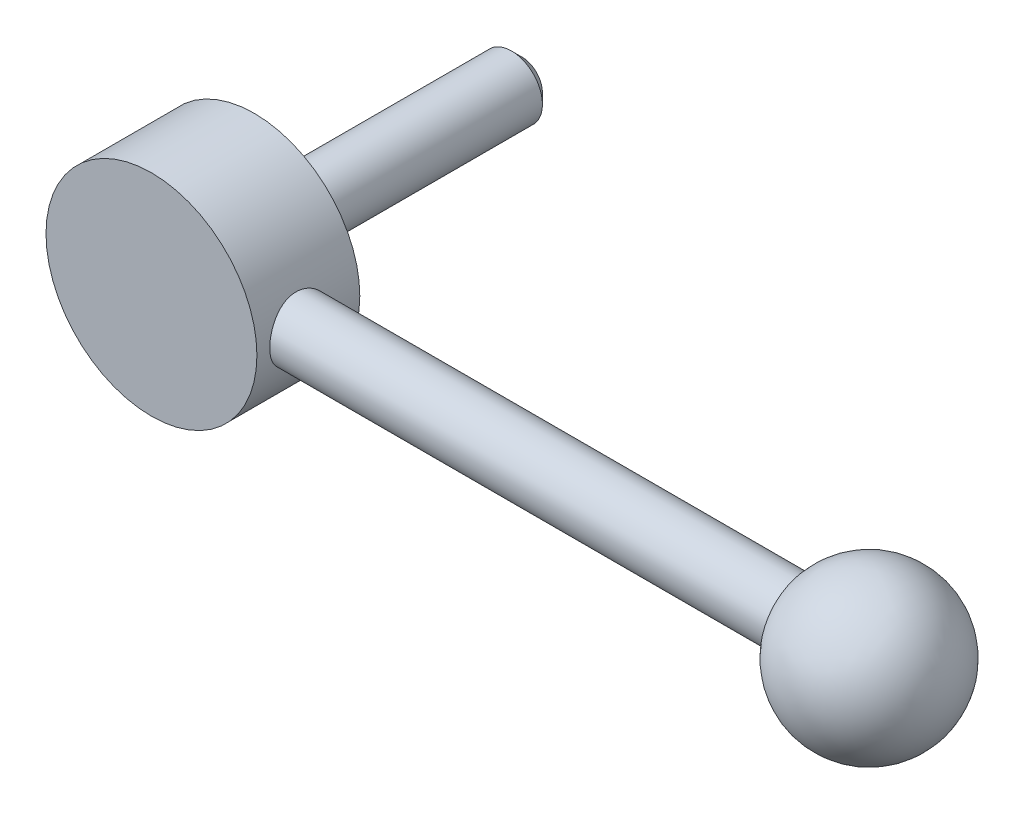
ISO-10303-21;
HEADER;
FILE_DESCRIPTION(('STEP AP214'),'2;1');
FILE_NAME('part.step','',(''),(''),'','','');
FILE_SCHEMA(('AUTOMOTIVE_DESIGN { 1 0 10303 214 1 1 1 1 }'));
ENDSEC;
DATA;
#1=APPLICATION_CONTEXT('core data for automotive mechanical design processes');
#2=APPLICATION_PROTOCOL_DEFINITION('international standard','automotive_design',2000,#1);
#3=PRODUCT_CONTEXT('',#1,'mechanical');
#4=PRODUCT('Part','Part','',(#3));
#5=PRODUCT_RELATED_PRODUCT_CATEGORY('part','',(#4));
#6=PRODUCT_DEFINITION_FORMATION('','',#4);
#7=PRODUCT_DEFINITION_CONTEXT('part definition',#1,'design');
#8=PRODUCT_DEFINITION('design','',#6,#7);
#9=PRODUCT_DEFINITION_SHAPE('','',#8);
#10=(LENGTH_UNIT() NAMED_UNIT(*) SI_UNIT(.MILLI.,.METRE.));
#11=(NAMED_UNIT(*) PLANE_ANGLE_UNIT() SI_UNIT($,.RADIAN.));
#12=(NAMED_UNIT(*) SI_UNIT($,.STERADIAN.) SOLID_ANGLE_UNIT());
#13=UNCERTAINTY_MEASURE_WITH_UNIT(LENGTH_MEASURE(1.E-05),#10,'distance_accuracy_value','');
#14=(GEOMETRIC_REPRESENTATION_CONTEXT(3) GLOBAL_UNCERTAINTY_ASSIGNED_CONTEXT((#13)) GLOBAL_UNIT_ASSIGNED_CONTEXT((#10,
#11,#12)) REPRESENTATION_CONTEXT('',''));
#15=CARTESIAN_POINT('',(0.,0.,0.));
#16=DIRECTION('',(0.,0.,1.));
#17=DIRECTION('',(1.,0.,0.));
#18=AXIS2_PLACEMENT_3D('',#15,#16,#17);
#19=CARTESIAN_POINT('',(0.,0.,40.));
#20=DIRECTION('',(0.,0.,1.));
#21=DIRECTION('',(1.,0.,0.));
#22=AXIS2_PLACEMENT_3D('',#19,#20,#21);
#23=CYLINDRICAL_SURFACE('',#22,9.5);
#24=CARTESIAN_POINT('',(0.,0.,2.));
#25=DIRECTION('',(0.,0.,1.));
#26=DIRECTION('',(1.,0.,0.));
#27=AXIS2_PLACEMENT_3D('',#24,#25,#26);
#28=CIRCLE('',#27,9.5);
#29=CARTESIAN_POINT('',(9.5,0.,2.));
#30=VERTEX_POINT('',#29);
#31=EDGE_CURVE('E37',#30,#30,#28,.T.);
#32=ORIENTED_EDGE('',*,*,#31,.F.);
#33=EDGE_LOOP('',(#32));
#34=FACE_BOUND('',#33,.T.);
#35=CARTESIAN_POINT('',(0.,0.,0.));
#36=DIRECTION('',(0.,0.,1.));
#37=DIRECTION('',(1.,0.,0.));
#38=AXIS2_PLACEMENT_3D('',#35,#36,#37);
#39=CIRCLE('',#38,9.5);
#40=CARTESIAN_POINT('',(9.5,0.,0.));
#41=VERTEX_POINT('',#40);
#42=EDGE_CURVE('E23',#41,#41,#39,.T.);
#43=ORIENTED_EDGE('',*,*,#42,.T.);
#44=EDGE_LOOP('',(#43));
#45=FACE_BOUND('',#44,.T.);
#46=ADVANCED_FACE('F12',(#34,#45),#23,.T.);
#47=CARTESIAN_POINT('',(6.,0.,0.));
#48=DIRECTION('',(0.,0.,1.));
#49=DIRECTION('',(1.,0.,0.));
#50=AXIS2_PLACEMENT_3D('',#47,#48,#49);
#51=PLANE('',#50);
#52=ORIENTED_EDGE('',*,*,#42,.F.);
#53=EDGE_LOOP('',(#52));
#54=FACE_BOUND('',#53,.T.);
#55=CARTESIAN_POINT('',(0.,0.,0.));
#56=DIRECTION('',(0.,0.,1.));
#57=DIRECTION('',(1.,0.,0.));
#58=AXIS2_PLACEMENT_3D('',#55,#56,#57);
#59=CIRCLE('',#58,6.);
#60=CARTESIAN_POINT('',(6.,0.,0.));
#61=VERTEX_POINT('',#60);
#62=EDGE_CURVE('E27',#61,#61,#59,.T.);
#63=ORIENTED_EDGE('',*,*,#62,.T.);
#64=EDGE_LOOP('',(#63));
#65=FACE_BOUND('',#64,.T.);
#66=ADVANCED_FACE('F63',(#54,#65),#51,.F.);
#67=CARTESIAN_POINT('',(0.,0.,40.));
#68=DIRECTION('',(0.,0.,1.));
#69=DIRECTION('',(1.,0.,0.));
#70=AXIS2_PLACEMENT_3D('',#67,#68,#69);
#71=CYLINDRICAL_SURFACE('',#70,6.);
#72=CARTESIAN_POINT('',(0.,0.,-48.));
#73=DIRECTION('',(0.,0.,-1.));
#74=DIRECTION('',(-1.,0.,0.));
#75=AXIS2_PLACEMENT_3D('',#72,#73,#74);
#76=CIRCLE('',#75,6.);
#77=CARTESIAN_POINT('',(-6.,0.,-48.));
#78=VERTEX_POINT('',#77);
#79=EDGE_CURVE('E19',#78,#78,#76,.F.);
#80=ORIENTED_EDGE('',*,*,#79,.T.);
#81=EDGE_LOOP('',(#80));
#82=FACE_BOUND('',#81,.T.);
#83=ORIENTED_EDGE('',*,*,#62,.F.);
#84=EDGE_LOOP('',(#83));
#85=FACE_BOUND('',#84,.T.);
#86=ADVANCED_FACE('F69',(#82,#85),#71,.T.);
#87=CARTESIAN_POINT('',(6.,0.,-50.));
#88=DIRECTION('',(0.,0.,-1.));
#89=DIRECTION('',(-1.,0.,0.));
#90=AXIS2_PLACEMENT_3D('',#87,#88,#89);
#91=PLANE('',#90);
#92=CARTESIAN_POINT('',(0.,0.,-50.));
#93=DIRECTION('',(0.,0.,-1.));
#94=DIRECTION('',(-1.,0.,0.));
#95=AXIS2_PLACEMENT_3D('',#92,#93,#94);
#96=CIRCLE('',#95,4.);
#97=CARTESIAN_POINT('',(-4.,0.,-50.));
#98=VERTEX_POINT('',#97);
#99=EDGE_CURVE('E8',#98,#98,#96,.T.);
#100=ORIENTED_EDGE('',*,*,#99,.T.);
#101=EDGE_LOOP('',(#100));
#102=FACE_BOUND('',#101,.T.);
#103=ADVANCED_FACE('F77',(#102),#91,.T.);
#104=CARTESIAN_POINT('',(20.5,0.,22.));
#105=DIRECTION('',(0.,0.,-1.));
#106=DIRECTION('',(-1.,0.,0.));
#107=AXIS2_PLACEMENT_3D('',#104,#105,#106);
#108=PLANE('',#107);
#109=CARTESIAN_POINT('',(0.,0.,22.));
#110=DIRECTION('',(0.,0.,1.));
#111=DIRECTION('',(1.,0.,0.));
#112=AXIS2_PLACEMENT_3D('',#109,#110,#111);
#113=CIRCLE('',#112,20.5);
#114=CARTESIAN_POINT('',(20.5,0.,22.));
#115=VERTEX_POINT('',#114);
#116=EDGE_CURVE('E86',#115,#115,#113,.T.);
#117=ORIENTED_EDGE('',*,*,#116,.T.);
#118=EDGE_LOOP('',(#117));
#119=FACE_BOUND('',#118,.T.);
#120=ADVANCED_FACE('F58',(#119),#108,.F.);
#121=CARTESIAN_POINT('',(0.,0.,40.));
#122=DIRECTION('',(0.,0.,1.));
#123=DIRECTION('',(1.,0.,0.));
#124=AXIS2_PLACEMENT_3D('',#121,#122,#123);
#125=CYLINDRICAL_SURFACE('',#124,20.5);
#126=CARTESIAN_POINT('',(20.5,0.,7.5));
#127=CARTESIAN_POINT('',(20.4999997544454,-0.164768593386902,7.50000038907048));
#128=CARTESIAN_POINT('',(20.4980087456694,-0.329544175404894,7.50679278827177));
#129=CARTESIAN_POINT('',(20.4900990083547,-0.65788822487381,7.5339021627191));
#130=CARTESIAN_POINT('',(20.4841800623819,-0.821456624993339,7.55421988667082));
#131=CARTESIAN_POINT('',(20.4685766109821,-1.1462122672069,7.60820100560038));
#132=CARTESIAN_POINT('',(20.4588916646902,-1.30739922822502,7.64186596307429));
#133=CARTESIAN_POINT('',(20.4360164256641,-1.62628314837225,7.72226244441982));
#134=CARTESIAN_POINT('',(20.4228249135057,-1.7839788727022,7.76899851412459));
#135=CARTESIAN_POINT('',(20.3933182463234,-2.09448185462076,7.87505403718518));
#136=CARTESIAN_POINT('',(20.3770082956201,-2.24729676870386,7.93435254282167));
#137=CARTESIAN_POINT('',(20.3416823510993,-2.54730770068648,8.06511256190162));
#138=CARTESIAN_POINT('',(20.3226662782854,-2.69450355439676,8.13657443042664));
#139=CARTESIAN_POINT('',(20.2824208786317,-2.98237032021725,8.2911456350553));
#140=CARTESIAN_POINT('',(20.2611910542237,-3.123039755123,8.37425759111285));
#141=CARTESIAN_POINT('',(20.2170775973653,-3.39691169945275,8.55150630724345));
#142=CARTESIAN_POINT('',(20.1941944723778,-3.53011647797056,8.6456396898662));
#143=CARTESIAN_POINT('',(20.146767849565,-3.79154794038,8.84682399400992));
#144=CARTESIAN_POINT('',(20.1221971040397,-3.91956600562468,8.95413966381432));
#145=CARTESIAN_POINT('',(20.0725990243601,-4.1661228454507,9.17897611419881));
#146=CARTESIAN_POINT('',(20.0475718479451,-4.2846648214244,9.29649342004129));
#147=CARTESIAN_POINT('',(19.9977175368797,-4.5116297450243,9.54108035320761));
#148=CARTESIAN_POINT('',(19.9728905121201,-4.62004743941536,9.66815487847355));
#149=CARTESIAN_POINT('',(19.9241410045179,-4.82595045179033,9.93095842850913));
#150=CARTESIAN_POINT('',(19.9002181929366,-4.92343976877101,10.0666842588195));
#151=CARTESIAN_POINT('',(19.8534354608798,-5.10885934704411,10.3490171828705));
#152=CARTESIAN_POINT('',(19.8306098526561,-5.19653638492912,10.4957964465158));
#153=CARTESIAN_POINT('',(19.7872868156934,-5.35913808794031,10.7965125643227));
#154=CARTESIAN_POINT('',(19.766788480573,-5.43406772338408,10.9504465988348));
#155=CARTESIAN_POINT('',(19.7287391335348,-5.57062666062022,11.2645036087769));
#156=CARTESIAN_POINT('',(19.7111887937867,-5.63225293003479,11.4246279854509));
#157=CARTESIAN_POINT('',(19.6796082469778,-5.74162541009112,11.7498143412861));
#158=CARTESIAN_POINT('',(19.6655765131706,-5.78937764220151,11.9148741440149));
#159=CARTESIAN_POINT('',(19.6418018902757,-5.86952471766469,12.2443484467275));
#160=CARTESIAN_POINT('',(19.6319555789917,-5.90229162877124,12.4086649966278));
#161=CARTESIAN_POINT('',(19.6163432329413,-5.95397424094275,12.7395899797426));
#162=CARTESIAN_POINT('',(19.6105755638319,-5.97289549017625,12.9061974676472));
#163=CARTESIAN_POINT('',(19.603301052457,-5.99672775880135,13.2405034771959));
#164=CARTESIAN_POINT('',(19.6017941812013,-6.00163887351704,13.4082019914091));
#165=CARTESIAN_POINT('',(19.6030905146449,-5.99740342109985,13.7434027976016));
#166=CARTESIAN_POINT('',(19.6058936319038,-5.98825713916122,13.9109050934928));
#167=CARTESIAN_POINT('',(19.6155486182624,-5.95655212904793,14.238688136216));
#168=CARTESIAN_POINT('',(19.6222578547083,-5.9344657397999,14.3990190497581));
#169=CARTESIAN_POINT('',(19.6394095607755,-5.87745500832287,14.7172343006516));
#170=CARTESIAN_POINT('',(19.649853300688,-5.84252629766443,14.8751177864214));
#171=CARTESIAN_POINT('',(19.6741615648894,-5.7601395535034,15.187257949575));
#172=CARTESIAN_POINT('',(19.688025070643,-5.71268525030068,15.3415156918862));
#173=CARTESIAN_POINT('',(19.7187796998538,-5.60560692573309,15.6454959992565));
#174=CARTESIAN_POINT('',(19.7356719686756,-5.5459782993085,15.7952168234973));
#175=CARTESIAN_POINT('',(19.7722410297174,-5.41416819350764,16.0910079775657));
#176=CARTESIAN_POINT('',(19.7919506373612,-5.34183608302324,16.2370072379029));
#177=CARTESIAN_POINT('',(19.8334359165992,-5.18568691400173,16.5224423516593));
#178=CARTESIAN_POINT('',(19.8552123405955,-5.10186566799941,16.6618757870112));
#179=CARTESIAN_POINT('',(19.9227548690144,-4.8340177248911,17.0689782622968));
#180=CARTESIAN_POINT('',(19.9707648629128,-4.63350124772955,17.3256854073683));
#181=CARTESIAN_POINT('',(20.0696162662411,-4.18511260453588,17.8126329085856));
#182=CARTESIAN_POINT('',(20.1204944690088,-3.93567819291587,18.0414205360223));
#183=CARTESIAN_POINT('',(20.2176813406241,-3.40132203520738,18.4542852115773));
#184=CARTESIAN_POINT('',(20.2639897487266,-3.11639826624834,18.63835970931));
#185=CARTESIAN_POINT('',(20.3472018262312,-2.51664006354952,18.9573414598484));
#186=CARTESIAN_POINT('',(20.3840462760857,-2.2016334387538,19.0919412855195));
#187=CARTESIAN_POINT('',(20.4437541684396,-1.55212614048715,19.3058343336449));
#188=CARTESIAN_POINT('',(20.4666213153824,-1.21763065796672,19.3851422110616));
#189=CARTESIAN_POINT('',(20.4952175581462,-0.550953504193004,19.4838192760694));
#190=CARTESIAN_POINT('',(20.5015074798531,-0.219085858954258,19.5051506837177));
#191=CARTESIAN_POINT('',(20.4978783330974,0.44350281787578,19.4927506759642));
#192=CARTESIAN_POINT('',(20.4879613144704,0.774223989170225,19.4590262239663));
#193=CARTESIAN_POINT('',(20.4533992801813,1.41781519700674,19.3390673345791));
#194=CARTESIAN_POINT('',(20.4290727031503,1.73091547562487,19.253967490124));
#195=CARTESIAN_POINT('',(20.3684901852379,2.33834273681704,19.0350155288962));
#196=CARTESIAN_POINT('',(20.3322328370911,2.63266749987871,18.901157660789));
#197=CARTESIAN_POINT('',(20.2505580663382,3.201467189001,18.585163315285));
#198=CARTESIAN_POINT('',(20.2049537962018,3.47535043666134,18.4020133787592));
#199=CARTESIAN_POINT('',(20.1098009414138,3.98926947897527,17.9937010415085));
#200=CARTESIAN_POINT('',(20.0602514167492,4.22929716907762,17.7685286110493));
#201=CARTESIAN_POINT('',(19.9860369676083,4.56311282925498,17.3996018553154));
#202=CARTESIAN_POINT('',(19.9608943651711,4.67160496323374,17.2689475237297));
#203=CARTESIAN_POINT('',(19.9116554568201,4.87720494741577,16.9988051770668));
#204=CARTESIAN_POINT('',(19.8875587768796,4.97431688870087,16.8593203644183));
#205=CARTESIAN_POINT('',(19.8411019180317,5.15650338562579,16.5723575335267));
#206=CARTESIAN_POINT('',(19.8187424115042,5.24157329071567,16.4248764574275));
#207=CARTESIAN_POINT('',(19.7764458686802,5.39896546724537,16.1230001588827));
#208=CARTESIAN_POINT('',(19.7565078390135,5.47129297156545,15.9686078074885));
#209=CARTESIAN_POINT('',(19.7197444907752,5.60234699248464,15.6546484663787));
#210=CARTESIAN_POINT('',(19.7029051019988,5.6611353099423,15.49510893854));
#211=CARTESIAN_POINT('',(19.6727610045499,5.76501533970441,15.1713718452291));
#212=CARTESIAN_POINT('',(19.6594548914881,5.81011249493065,15.0071761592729));
#213=CARTESIAN_POINT('',(19.6367999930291,5.88622676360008,14.675294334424));
#214=CARTESIAN_POINT('',(19.6274509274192,5.91724487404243,14.5076084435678));
#215=CARTESIAN_POINT('',(19.6130187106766,5.96490739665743,14.1700260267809));
#216=CARTESIAN_POINT('',(19.6079354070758,5.98155232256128,14.0001295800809));
#217=CARTESIAN_POINT('',(19.6023186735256,5.9999323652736,13.6662567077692));
#218=CARTESIAN_POINT('',(19.6016119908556,6.00223524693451,13.5023141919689));
#219=CARTESIAN_POINT('',(19.6043094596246,5.99341910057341,13.1747666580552));
#220=CARTESIAN_POINT('',(19.6077150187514,5.98229547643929,13.0111617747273));
#221=CARTESIAN_POINT('',(19.6185313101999,5.94672790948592,12.6856110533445));
#222=CARTESIAN_POINT('',(19.6259403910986,5.92228945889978,12.5236645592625));
#223=CARTESIAN_POINT('',(19.6445384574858,5.86030325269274,12.2024601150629));
#224=CARTESIAN_POINT('',(19.6557288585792,5.82275058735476,12.0432031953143));
#225=CARTESIAN_POINT('',(19.6814005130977,5.73537439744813,11.7303823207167));
#226=CARTESIAN_POINT('',(19.6958418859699,5.68569901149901,11.5767736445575));
#227=CARTESIAN_POINT('',(19.7276768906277,5.57423736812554,11.2742707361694));
#228=CARTESIAN_POINT('',(19.7450715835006,5.51244675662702,11.125378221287));
#229=CARTESIAN_POINT('',(19.782319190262,5.37724463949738,10.8333301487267));
#230=CARTESIAN_POINT('',(19.802171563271,5.30383568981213,10.6901733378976));
#231=CARTESIAN_POINT('',(19.8438063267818,5.14587421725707,10.4103722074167));
#232=CARTESIAN_POINT('',(19.8655894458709,5.061317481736,10.2737303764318));
#233=CARTESIAN_POINT('',(19.9112797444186,4.87853600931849,10.0032239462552));
#234=CARTESIAN_POINT('',(19.9352342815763,4.77994030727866,9.86961789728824));
#235=CARTESIAN_POINT('',(19.9839347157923,4.57206196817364,9.61107007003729));
#236=CARTESIAN_POINT('',(20.0086809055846,4.46277534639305,9.48613155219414));
#237=CARTESIAN_POINT('',(20.0582834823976,4.23425660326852,9.24575891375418));
#238=CARTESIAN_POINT('',(20.0831398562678,4.11502564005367,9.13032368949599));
#239=CARTESIAN_POINT('',(20.1323098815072,3.86730499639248,8.90963180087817));
#240=CARTESIAN_POINT('',(20.1566233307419,3.7388119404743,8.80437888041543));
#241=CARTESIAN_POINT('',(20.2046974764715,3.46977987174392,8.6020699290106));
#242=CARTESIAN_POINT('',(20.2284250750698,3.32900807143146,8.50531528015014));
#243=CARTESIAN_POINT('',(20.2739466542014,3.03949915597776,8.32403500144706));
#244=CARTESIAN_POINT('',(20.2957406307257,2.8907620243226,8.23950939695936));
#245=CARTESIAN_POINT('',(20.3367679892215,2.58639447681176,8.0833769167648));
#246=CARTESIAN_POINT('',(20.356002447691,2.43076699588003,8.01176460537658));
#247=CARTESIAN_POINT('',(20.3913677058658,2.11366097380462,7.88201306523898));
#248=CARTESIAN_POINT('',(20.4074988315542,1.95218304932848,7.82387242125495));
#249=CARTESIAN_POINT('',(20.4344672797,1.64423058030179,7.72771145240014));
#250=CARTESIAN_POINT('',(20.4457076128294,1.49828162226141,7.68811373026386));
#251=CARTESIAN_POINT('',(20.4651675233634,1.2036242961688,7.62002138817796));
#252=CARTESIAN_POINT('',(20.4733873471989,1.0549161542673,7.59152586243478));
#253=CARTESIAN_POINT('',(20.4866168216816,0.755624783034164,7.54584620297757));
#254=CARTESIAN_POINT('',(20.491626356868,0.605041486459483,7.52866247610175));
#255=CARTESIAN_POINT('',(20.49831762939,0.302973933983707,7.50574067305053));
#256=CARTESIAN_POINT('',(20.5000002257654,0.151489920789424,7.49999964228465));
#257=CARTESIAN_POINT('',(20.5,0.,7.5));
#258=B_SPLINE_CURVE_WITH_KNOTS('',3,(#126,#127,#128,#129,#130,#131,#132,#133,#134,#135,#136,
#137,#138,#139,#140,#141,#142,#143,#144,#145,#146,#147,#148,#149,#150,#151,#152,#153,#154,#155,
#156,#157,#158,#159,#160,#161,#162,#163,#164,#165,#166,#167,#168,#169,#170,#171,#172,#173,#174,
#175,#176,#177,#178,#179,#180,#181,#182,#183,#184,#185,#186,#187,#188,#189,#190,#191,#192,#193,
#194,#195,#196,#197,#198,#199,#200,#201,#202,#203,#204,#205,#206,#207,#208,#209,#210,#211,#212,
#213,#214,#215,#216,#217,#218,#219,#220,#221,#222,#223,#224,#225,#226,#227,#228,#229,#230,#231,
#232,#233,#234,#235,#236,#237,#238,#239,#240,#241,#242,#243,#244,#245,#246,#247,#248,#249,#250,
#251,#252,#253,#254,#255,#256,#257),.UNSPECIFIED.,.T.,.F.,(4,2,2,2,2,2,2,2,2,2,2,2,2,2,2,2,2,2,
2,2,2,2,2,2,2,2,2,2,2,2,2,2,2,2,2,2,2,2,2,2,2,2,2,2,2,2,2,2,2,2,2,2,2,2,2,2,2,2,2,2,2,2,2,2,2,
4),(0.,0.494166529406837,0.988360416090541,1.48261217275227,1.97703603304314,2.47064184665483,
2.96426207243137,3.45799348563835,3.95157399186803,4.45753270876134,4.96331976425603,
5.46936781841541,5.97523008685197,6.49206535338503,7.00869863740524,7.52544955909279,
8.04197586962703,8.54486934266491,9.04756118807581,9.55024961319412,10.0529278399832,
10.5383093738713,11.0238561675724,11.5092585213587,11.9948448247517,12.4866344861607,
12.9786038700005,13.9617709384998,14.9839152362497,16.006117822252,17.0345689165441,
18.062747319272,19.0556662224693,20.0484595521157,21.0200911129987,21.9918373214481,
22.9853318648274,23.97906383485,24.4935931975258,25.0079370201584,25.5224789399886,
26.0368090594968,26.5487427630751,27.0604726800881,27.5721663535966,28.0838417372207,
28.5751252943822,29.066577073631,29.5578262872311,30.0492596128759,30.5349645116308,
31.0208442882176,31.5066173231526,31.9925744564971,32.4953010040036,32.9982156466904,
33.5010718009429,34.0041121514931,34.5208552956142,35.0375995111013,35.5541256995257,
36.0705976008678,36.525077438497,36.9795201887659,37.4339792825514,37.8883210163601),.UNSPECIFIED.);
#259=CARTESIAN_POINT('',(20.5,0.,7.5));
#260=VERTEX_POINT('',#259);
#261=EDGE_CURVE('E30',#260,#260,#258,.T.);
#262=ORIENTED_EDGE('',*,*,#261,.T.);
#263=EDGE_LOOP('',(#262));
#264=FACE_BOUND('',#263,.T.);
#265=ORIENTED_EDGE('',*,*,#116,.F.);
#266=EDGE_LOOP('',(#265));
#267=FACE_BOUND('',#266,.T.);
#268=CARTESIAN_POINT('',(0.,0.,2.));
#269=DIRECTION('',(0.,0.,1.));
#270=DIRECTION('',(1.,0.,0.));
#271=AXIS2_PLACEMENT_3D('',#268,#269,#270);
#272=CIRCLE('',#271,20.5);
#273=CARTESIAN_POINT('',(20.5,0.,2.));
#274=VERTEX_POINT('',#273);
#275=EDGE_CURVE('E88',#274,#274,#272,.T.);
#276=ORIENTED_EDGE('',*,*,#275,.T.);
#277=EDGE_LOOP('',(#276));
#278=FACE_BOUND('',#277,.T.);
#279=ADVANCED_FACE('F40',(#264,#267,#278),#125,.T.);
#280=CARTESIAN_POINT('',(9.5,0.,2.));
#281=DIRECTION('',(0.,0.,1.));
#282=DIRECTION('',(1.,0.,0.));
#283=AXIS2_PLACEMENT_3D('',#280,#281,#282);
#284=PLANE('',#283);
#285=ORIENTED_EDGE('',*,*,#275,.F.);
#286=EDGE_LOOP('',(#285));
#287=FACE_BOUND('',#286,.T.);
#288=ORIENTED_EDGE('',*,*,#31,.T.);
#289=EDGE_LOOP('',(#288));
#290=FACE_BOUND('',#289,.T.);
#291=ADVANCED_FACE('F49',(#287,#290),#284,.F.);
#292=CARTESIAN_POINT('',(-30.,0.,13.5));
#293=DIRECTION('',(-1.,0.,0.));
#294=DIRECTION('',(0.,0.,1.));
#295=AXIS2_PLACEMENT_3D('',#292,#293,#294);
#296=CYLINDRICAL_SURFACE('',#295,6.);
#297=CARTESIAN_POINT('',(117.252272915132,0.,13.5));
#298=DIRECTION('',(-1.,0.,0.));
#299=DIRECTION('',(0.,0.,1.));
#300=AXIS2_PLACEMENT_3D('',#297,#298,#299);
#301=CIRCLE('',#300,6.);
#302=CARTESIAN_POINT('',(117.252272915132,0.,19.5));
#303=VERTEX_POINT('',#302);
#304=EDGE_CURVE('E38',#303,#303,#301,.T.);
#305=ORIENTED_EDGE('',*,*,#304,.T.);
#306=EDGE_LOOP('',(#305));
#307=FACE_BOUND('',#306,.T.);
#308=ORIENTED_EDGE('',*,*,#261,.F.);
#309=EDGE_LOOP('',(#308));
#310=FACE_BOUND('',#309,.T.);
#311=ADVANCED_FACE('F44',(#307,#310),#296,.T.);
#312=CARTESIAN_POINT('',(131.,0.,13.5));
#313=DIRECTION('',(0.,0.,1.));
#314=DIRECTION('',(1.,0.,0.));
#315=AXIS2_PLACEMENT_3D('',#312,#313,#314);
#316=SPHERICAL_SURFACE('',#315,15.);
#317=CARTESIAN_POINT('',(131.,0.,13.5));
#318=DIRECTION('',(-1.,0.,0.));
#319=DIRECTION('',(0.,0.,1.));
#320=AXIS2_PLACEMENT_3D('',#317,#318,#319);
#321=SPHERICAL_SURFACE('',#320,15.);
#322=ORIENTED_EDGE('',*,*,#304,.F.);
#323=EDGE_LOOP('',(#322));
#324=FACE_BOUND('',#323,.T.);
#325=ADVANCED_FACE('F48',(#324),#321,.T.);
#326=CARTESIAN_POINT('',(0.,0.,-48.));
#327=DIRECTION('',(0.,0.,1.));
#328=DIRECTION('',(1.,0.,0.));
#329=AXIS2_PLACEMENT_3D('',#326,#327,#328);
#330=CONICAL_SURFACE('',#329,6.,0.785398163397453);
#331=ORIENTED_EDGE('',*,*,#99,.F.);
#332=EDGE_LOOP('',(#331));
#333=FACE_BOUND('',#332,.T.);
#334=ORIENTED_EDGE('',*,*,#79,.F.);
#335=EDGE_LOOP('',(#334));
#336=FACE_BOUND('',#335,.T.);
#337=ADVANCED_FACE('F14',(#333,#336),#330,.T.);
#338=CLOSED_SHELL('',(#46,#66,#86,#103,#120,#279,#291,#311,#325,#337));
#339=MANIFOLD_SOLID_BREP('B1',#338);
#340=ADVANCED_BREP_SHAPE_REPRESENTATION('',(#18,#339),#14);
#341=SHAPE_DEFINITION_REPRESENTATION(#9,#340);
ENDSEC;
END-ISO-10303-21;
